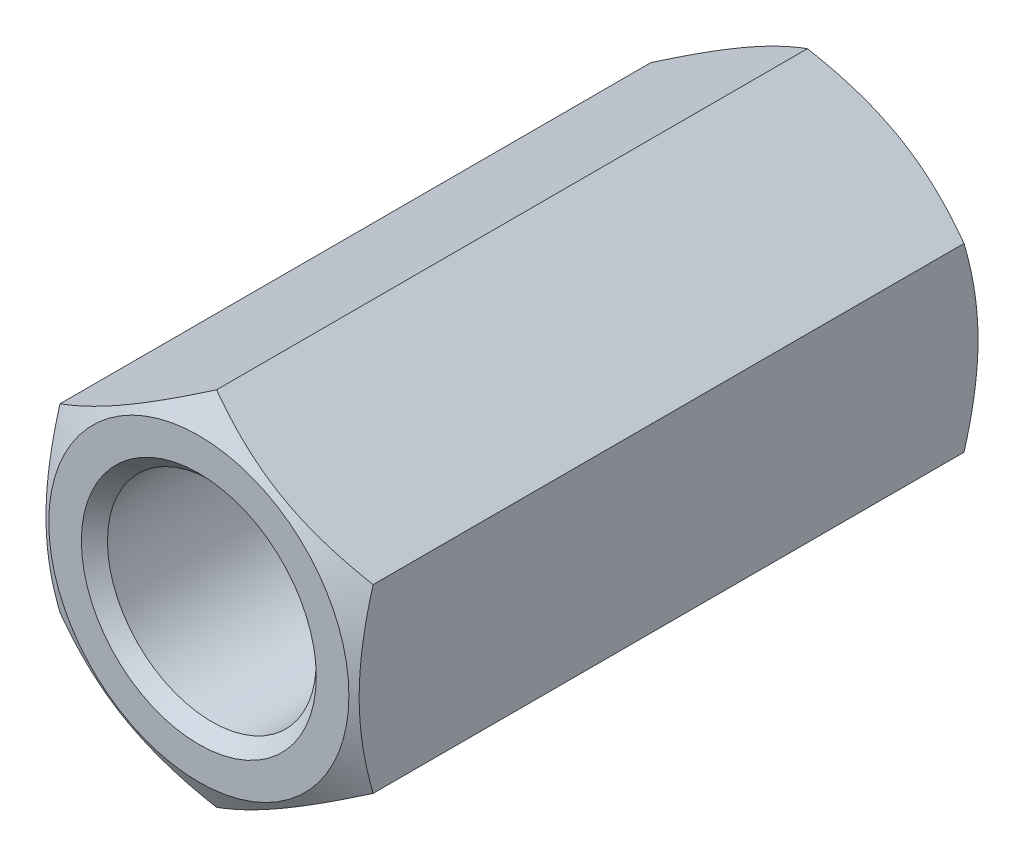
ISO-10303-21;
HEADER;
FILE_DESCRIPTION(('STEP AP214'),'2;1');
FILE_NAME('part.step','',(''),(''),'','','');
FILE_SCHEMA(('AUTOMOTIVE_DESIGN { 1 0 10303 214 1 1 1 1 }'));
ENDSEC;
DATA;
#1=APPLICATION_CONTEXT('core data for automotive mechanical design processes');
#2=APPLICATION_PROTOCOL_DEFINITION('international standard','automotive_design',2000,#1);
#3=PRODUCT_CONTEXT('',#1,'mechanical');
#4=PRODUCT('Part','Part','',(#3));
#5=PRODUCT_RELATED_PRODUCT_CATEGORY('part','',(#4));
#6=PRODUCT_DEFINITION_FORMATION('','',#4);
#7=PRODUCT_DEFINITION_CONTEXT('part definition',#1,'design');
#8=PRODUCT_DEFINITION('design','',#6,#7);
#9=PRODUCT_DEFINITION_SHAPE('','',#8);
#10=(LENGTH_UNIT() NAMED_UNIT(*) SI_UNIT(.MILLI.,.METRE.));
#11=(NAMED_UNIT(*) PLANE_ANGLE_UNIT() SI_UNIT($,.RADIAN.));
#12=(NAMED_UNIT(*) SI_UNIT($,.STERADIAN.) SOLID_ANGLE_UNIT());
#13=UNCERTAINTY_MEASURE_WITH_UNIT(LENGTH_MEASURE(1.E-05),#10,'distance_accuracy_value','');
#14=(GEOMETRIC_REPRESENTATION_CONTEXT(3) GLOBAL_UNCERTAINTY_ASSIGNED_CONTEXT((#13)) GLOBAL_UNIT_ASSIGNED_CONTEXT((#10,
#11,#12)) REPRESENTATION_CONTEXT('',''));
#15=CARTESIAN_POINT('',(0.,0.,0.));
#16=DIRECTION('',(0.,0.,1.));
#17=DIRECTION('',(1.,0.,0.));
#18=AXIS2_PLACEMENT_3D('',#15,#16,#17);
#19=CARTESIAN_POINT('',(-12.,-6.92820323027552,48.));
#20=DIRECTION('',(0.,0.,-1.));
#21=DIRECTION('',(-1.,0.,0.));
#22=AXIS2_PLACEMENT_3D('',#19,#20,#21);
#23=PLANE('',#22);
#24=CARTESIAN_POINT('',(0.,0.,48.));
#25=DIRECTION('',(0.,0.,-1.));
#26=DIRECTION('',(-1.,0.,0.));
#27=AXIS2_PLACEMENT_3D('',#24,#25,#26);
#28=CIRCLE('',#27,9.);
#29=CARTESIAN_POINT('',(-9.,0.,48.));
#30=VERTEX_POINT('',#29);
#31=EDGE_CURVE('E9',#30,#30,#28,.T.);
#32=ORIENTED_EDGE('',*,*,#31,.T.);
#33=EDGE_LOOP('',(#32));
#34=FACE_BOUND('',#33,.T.);
#35=CARTESIAN_POINT('',(0.,0.,48.));
#36=DIRECTION('',(0.,0.,-1.));
#37=DIRECTION('',(-1.,0.,0.));
#38=AXIS2_PLACEMENT_3D('',#35,#36,#37);
#39=CIRCLE('',#38,11.5);
#40=CARTESIAN_POINT('',(-11.5,0.,48.));
#41=VERTEX_POINT('',#40);
#42=EDGE_CURVE('E209',#41,#41,#39,.T.);
#43=ORIENTED_EDGE('',*,*,#42,.F.);
#44=EDGE_LOOP('',(#43));
#45=FACE_BOUND('',#44,.T.);
#46=ADVANCED_FACE('F14',(#34,#45),#23,.F.);
#47=CARTESIAN_POINT('',(-12.,-6.92820323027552,0.));
#48=DIRECTION('',(0.,0.,-1.));
#49=DIRECTION('',(-1.,0.,0.));
#50=AXIS2_PLACEMENT_3D('',#47,#48,#49);
#51=PLANE('',#50);
#52=CARTESIAN_POINT('',(0.,0.,0.));
#53=DIRECTION('',(0.,0.,-1.));
#54=DIRECTION('',(-1.,0.,0.));
#55=AXIS2_PLACEMENT_3D('',#52,#53,#54);
#56=CIRCLE('',#55,9.);
#57=CARTESIAN_POINT('',(-9.,0.,0.));
#58=VERTEX_POINT('',#57);
#59=EDGE_CURVE('E74',#58,#58,#56,.F.);
#60=ORIENTED_EDGE('',*,*,#59,.T.);
#61=EDGE_LOOP('',(#60));
#62=FACE_BOUND('',#61,.T.);
#63=CARTESIAN_POINT('',(0.,0.,0.));
#64=DIRECTION('',(0.,0.,-1.));
#65=DIRECTION('',(-1.,0.,0.));
#66=AXIS2_PLACEMENT_3D('',#63,#64,#65);
#67=CIRCLE('',#66,11.5);
#68=CARTESIAN_POINT('',(-11.5,0.,0.));
#69=VERTEX_POINT('',#68);
#70=EDGE_CURVE('E85',#69,#69,#67,.T.);
#71=ORIENTED_EDGE('',*,*,#70,.T.);
#72=EDGE_LOOP('',(#71));
#73=FACE_BOUND('',#72,.T.);
#74=ADVANCED_FACE('F228',(#62,#73),#51,.T.);
#75=CARTESIAN_POINT('',(0.,-13.856406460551,48.));
#76=DIRECTION('',(-0.5,-0.86602540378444,0.));
#77=DIRECTION('',(0.86602540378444,-0.5,0.));
#78=AXIS2_PLACEMENT_3D('',#75,#76,#77);
#79=PLANE('',#78);
#80=CARTESIAN_POINT('',(0.000199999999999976,-13.8565219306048,1.36053857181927));
#81=CARTESIAN_POINT('',(-0.263585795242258,-13.7042251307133,1.27262476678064));
#82=CARTESIAN_POINT('',(-0.528355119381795,-13.5513604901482,1.18870113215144));
#83=CARTESIAN_POINT('',(-1.06001701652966,-13.244405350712,1.02994135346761));
#84=CARTESIAN_POINT('',(-1.32691025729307,-13.0903144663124,0.955108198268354));
#85=CARTESIAN_POINT('',(-2.131890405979,-12.6255589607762,0.745692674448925));
#86=CARTESIAN_POINT('',(-2.67315507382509,-12.3130596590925,0.626578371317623));
#87=CARTESIAN_POINT('',(-3.48313282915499,-11.8454187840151,0.486906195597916));
#88=CARTESIAN_POINT('',(-3.74942610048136,-11.6916742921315,0.447118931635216));
#89=CARTESIAN_POINT('',(-4.28324559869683,-11.3834734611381,0.380398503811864));
#90=CARTESIAN_POINT('',(-4.55077184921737,-11.2290171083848,0.35346558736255));
#91=CARTESIAN_POINT('',(-5.08627036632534,-10.9198468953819,0.313143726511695));
#92=CARTESIAN_POINT('',(-5.35424172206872,-10.7651335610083,0.299738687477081));
#93=CARTESIAN_POINT('',(-5.89043273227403,-10.4555635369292,0.286758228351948));
#94=CARTESIAN_POINT('',(-6.15865237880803,-10.3007068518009,0.287182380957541));
#95=CARTESIAN_POINT('',(-6.6600893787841,-10.011202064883,0.300895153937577));
#96=CARTESIAN_POINT('',(-6.89334249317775,-9.87653331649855,0.312511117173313));
#97=CARTESIAN_POINT('',(-7.35931224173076,-9.60750555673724,0.345983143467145));
#98=CARTESIAN_POINT('',(-7.59202883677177,-9.47314656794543,0.367839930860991));
#99=CARTESIAN_POINT('',(-8.05679907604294,-9.20481134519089,0.421412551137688));
#100=CARTESIAN_POINT('',(-8.288852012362,-9.07083551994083,0.453136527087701));
#101=CARTESIAN_POINT('',(-8.75186996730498,-8.80351197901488,0.525886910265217));
#102=CARTESIAN_POINT('',(-8.98283491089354,-8.67016430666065,0.566913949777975));
#103=CARTESIAN_POINT('',(-9.68394195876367,-8.26537996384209,0.704986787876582));
#104=CARTESIAN_POINT('',(-10.1520537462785,-7.99511549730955,0.815800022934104));
#105=CARTESIAN_POINT('',(-11.0812971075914,-7.45861659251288,1.06730090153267));
#106=CARTESIAN_POINT('',(-11.5424405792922,-7.19237528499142,1.20792947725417));
#107=CARTESIAN_POINT('',(-12.0002,-6.92808776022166,1.36053857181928));
#108=B_SPLINE_CURVE_WITH_KNOTS('',3,(#80,#81,#82,#83,#84,#85,#86,#87,#88,#89,#90,#91,#92,#93,
#94,#95,#96,#97,#98,#99,#100,#101,#102,#103,#104,#105,#106,#107),.UNSPECIFIED.,.F.,.F.,(4,2,2,2,
2,2,2,2,2,2,2,2,2,4),(0.,0.951004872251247,1.90232158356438,3.80900466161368,4.7389455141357,
5.66890426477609,6.59775529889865,7.5265776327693,8.33514643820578,9.14377244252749,
9.95306755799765,10.7624176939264,12.4167102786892,14.0677556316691),.UNSPECIFIED.);
#109=CARTESIAN_POINT('',(0.,-13.856406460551,1.36047190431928));
#110=VERTEX_POINT('',#109);
#111=CARTESIAN_POINT('',(-12.,-6.92820323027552,1.36047190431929));
#112=VERTEX_POINT('',#111);
#113=EDGE_CURVE('E29',#110,#112,#108,.T.);
#114=ORIENTED_EDGE('',*,*,#113,.F.);
#115=DIRECTION('',(0.,0.,-1.));
#116=VECTOR('',#115,1.);
#117=CARTESIAN_POINT('',(0.,-13.856406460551,48.));
#118=LINE('',#117,#116);
#119=CARTESIAN_POINT('',(0.,-13.856406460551,46.6395280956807));
#120=VERTEX_POINT('',#119);
#121=EDGE_CURVE('E101',#120,#110,#118,.T.);
#122=ORIENTED_EDGE('',*,*,#121,.F.);
#123=CARTESIAN_POINT('',(-12.0002,-6.92808776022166,46.6394614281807));
#124=CARTESIAN_POINT('',(-11.7364142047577,-7.08038456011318,46.7273752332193));
#125=CARTESIAN_POINT('',(-11.4716448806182,-7.2332492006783,46.8112988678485));
#126=CARTESIAN_POINT('',(-10.9399829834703,-7.54020434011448,46.9700586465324));
#127=CARTESIAN_POINT('',(-10.6730897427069,-7.69429522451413,47.0448918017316));
#128=CARTESIAN_POINT('',(-9.86810959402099,-8.15905073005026,47.254307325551));
#129=CARTESIAN_POINT('',(-9.3268449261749,-8.47155003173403,47.3734216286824));
#130=CARTESIAN_POINT('',(-8.516867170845,-8.93919090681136,47.5130938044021));
#131=CARTESIAN_POINT('',(-8.25057389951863,-9.09293539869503,47.5528810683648));
#132=CARTESIAN_POINT('',(-7.71675440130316,-9.4011362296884,47.6196014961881));
#133=CARTESIAN_POINT('',(-7.44922815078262,-9.55559258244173,47.6465344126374));
#134=CARTESIAN_POINT('',(-6.91372963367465,-9.86476279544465,47.6868562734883));
#135=CARTESIAN_POINT('',(-6.64575827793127,-10.0194761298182,47.7002613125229));
#136=CARTESIAN_POINT('',(-6.10956726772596,-10.3290461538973,47.713241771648));
#137=CARTESIAN_POINT('',(-5.84134762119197,-10.4839028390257,47.7128176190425));
#138=CARTESIAN_POINT('',(-5.3399106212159,-10.7734076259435,47.6991048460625));
#139=CARTESIAN_POINT('',(-5.10665750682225,-10.908076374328,47.6874888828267));
#140=CARTESIAN_POINT('',(-4.64068775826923,-11.1771041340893,47.6540168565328));
#141=CARTESIAN_POINT('',(-4.40797116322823,-11.3114631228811,47.632160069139));
#142=CARTESIAN_POINT('',(-3.94320092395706,-11.5797983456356,47.5785874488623));
#143=CARTESIAN_POINT('',(-3.711147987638,-11.7137741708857,47.5468634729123));
#144=CARTESIAN_POINT('',(-3.24813003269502,-11.9810977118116,47.4741130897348));
#145=CARTESIAN_POINT('',(-3.01716508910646,-12.1144453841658,47.433086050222));
#146=CARTESIAN_POINT('',(-2.31605804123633,-12.5192297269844,47.2950132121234));
#147=CARTESIAN_POINT('',(-1.84794625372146,-12.789494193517,47.1841999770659));
#148=CARTESIAN_POINT('',(-0.918702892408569,-13.3259930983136,46.9326990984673));
#149=CARTESIAN_POINT('',(-0.457559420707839,-13.5922344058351,46.7920705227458));
#150=CARTESIAN_POINT('',(0.000199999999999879,-13.8565219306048,46.6394614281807));
#151=B_SPLINE_CURVE_WITH_KNOTS('',3,(#123,#124,#125,#126,#127,#128,#129,#130,#131,#132,#133,
#134,#135,#136,#137,#138,#139,#140,#141,#142,#143,#144,#145,#146,#147,#148,#149,#150),
.UNSPECIFIED.,.F.,.F.,(4,2,2,2,2,2,2,2,2,2,2,2,2,4),(0.,0.951004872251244,1.90232158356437,
3.80900466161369,4.73894551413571,5.6689042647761,6.59775529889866,7.52657763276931,
8.33514643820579,9.14377244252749,9.95306755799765,10.7624176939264,12.4167102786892,
14.0677556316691),.UNSPECIFIED.);
#152=CARTESIAN_POINT('',(-12.,-6.92820323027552,46.6395280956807));
#153=VERTEX_POINT('',#152);
#154=EDGE_CURVE('E92',#153,#120,#151,.T.);
#155=ORIENTED_EDGE('',*,*,#154,.F.);
#156=DIRECTION('',(0.,0.,-1.));
#157=VECTOR('',#156,1.);
#158=CARTESIAN_POINT('',(-12.,-6.92820323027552,48.));
#159=LINE('',#158,#157);
#160=EDGE_CURVE('E88',#153,#112,#159,.T.);
#161=ORIENTED_EDGE('',*,*,#160,.T.);
#162=EDGE_LOOP('',(#114,#122,#155,#161));
#163=FACE_BOUND('',#162,.T.);
#164=ADVANCED_FACE('F124',(#163),#79,.T.);
#165=CARTESIAN_POINT('',(0.,-13.856406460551,48.));
#166=DIRECTION('',(-0.5,0.86602540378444,0.));
#167=DIRECTION('',(-0.86602540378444,-0.5,0.));
#168=AXIS2_PLACEMENT_3D('',#165,#166,#167);
#169=PLANE('',#168);
#170=ORIENTED_EDGE('',*,*,#121,.T.);
#171=CARTESIAN_POINT('',(-0.000200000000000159,-13.8565219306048,1.36053857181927));
#172=CARTESIAN_POINT('',(0.263585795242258,-13.7042251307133,1.27262476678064));
#173=CARTESIAN_POINT('',(0.528355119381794,-13.5513604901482,1.18870113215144));
#174=CARTESIAN_POINT('',(1.06001701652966,-13.244405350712,1.02994135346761));
#175=CARTESIAN_POINT('',(1.32691025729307,-13.0903144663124,0.955108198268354));
#176=CARTESIAN_POINT('',(2.131890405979,-12.6255589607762,0.745692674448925));
#177=CARTESIAN_POINT('',(2.67315507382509,-12.3130596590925,0.626578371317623));
#178=CARTESIAN_POINT('',(3.48313282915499,-11.8454187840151,0.486906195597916));
#179=CARTESIAN_POINT('',(3.74942610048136,-11.6916742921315,0.447118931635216));
#180=CARTESIAN_POINT('',(4.28324559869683,-11.3834734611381,0.380398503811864));
#181=CARTESIAN_POINT('',(4.55077184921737,-11.2290171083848,0.35346558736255));
#182=CARTESIAN_POINT('',(5.08627036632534,-10.9198468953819,0.313143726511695));
#183=CARTESIAN_POINT('',(5.35424172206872,-10.7651335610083,0.29973868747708));
#184=CARTESIAN_POINT('',(5.89043273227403,-10.4555635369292,0.286758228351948));
#185=CARTESIAN_POINT('',(6.15865237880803,-10.3007068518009,0.287182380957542));
#186=CARTESIAN_POINT('',(6.6600893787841,-10.011202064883,0.300895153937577));
#187=CARTESIAN_POINT('',(6.89334249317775,-9.87653331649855,0.312511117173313));
#188=CARTESIAN_POINT('',(7.35931224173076,-9.60750555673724,0.345983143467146));
#189=CARTESIAN_POINT('',(7.59202883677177,-9.47314656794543,0.367839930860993));
#190=CARTESIAN_POINT('',(8.05679907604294,-9.20481134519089,0.421412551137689));
#191=CARTESIAN_POINT('',(8.288852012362,-9.07083551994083,0.453136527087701));
#192=CARTESIAN_POINT('',(8.75186996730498,-8.80351197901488,0.525886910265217));
#193=CARTESIAN_POINT('',(8.98283491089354,-8.67016430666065,0.566913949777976));
#194=CARTESIAN_POINT('',(9.68394195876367,-8.26537996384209,0.704986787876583));
#195=CARTESIAN_POINT('',(10.1520537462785,-7.99511549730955,0.815800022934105));
#196=CARTESIAN_POINT('',(11.0812971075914,-7.45861659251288,1.06730090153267));
#197=CARTESIAN_POINT('',(11.5424405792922,-7.19237528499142,1.20792947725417));
#198=CARTESIAN_POINT('',(12.0002,-6.92808776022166,1.36053857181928));
#199=B_SPLINE_CURVE_WITH_KNOTS('',3,(#171,#172,#173,#174,#175,#176,#177,#178,#179,#180,#181,
#182,#183,#184,#185,#186,#187,#188,#189,#190,#191,#192,#193,#194,#195,#196,#197,#198),
.UNSPECIFIED.,.F.,.F.,(4,2,2,2,2,2,2,2,2,2,2,2,2,4),(0.,0.951004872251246,1.90232158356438,
3.80900466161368,4.7389455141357,5.66890426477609,6.59775529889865,7.5265776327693,
8.33514643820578,9.14377244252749,9.95306755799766,10.7624176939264,12.4167102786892,
14.0677556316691),.UNSPECIFIED.);
#200=CARTESIAN_POINT('',(12.,-6.92820323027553,1.36047190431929));
#201=VERTEX_POINT('',#200);
#202=EDGE_CURVE('E168',#110,#201,#199,.T.);
#203=ORIENTED_EDGE('',*,*,#202,.T.);
#204=DIRECTION('',(0.,0.,-1.));
#205=VECTOR('',#204,1.);
#206=CARTESIAN_POINT('',(12.,-6.92820323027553,48.));
#207=LINE('',#206,#205);
#208=CARTESIAN_POINT('',(12.,-6.92820323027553,46.6395280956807));
#209=VERTEX_POINT('',#208);
#210=EDGE_CURVE('E98',#209,#201,#207,.T.);
#211=ORIENTED_EDGE('',*,*,#210,.F.);
#212=CARTESIAN_POINT('',(12.0002,-6.92808776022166,46.6394614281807));
#213=CARTESIAN_POINT('',(11.7364142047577,-7.08038456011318,46.7273752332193));
#214=CARTESIAN_POINT('',(11.4716448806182,-7.2332492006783,46.8112988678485));
#215=CARTESIAN_POINT('',(10.9399829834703,-7.54020434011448,46.9700586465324));
#216=CARTESIAN_POINT('',(10.6730897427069,-7.69429522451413,47.0448918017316));
#217=CARTESIAN_POINT('',(9.86810959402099,-8.15905073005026,47.254307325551));
#218=CARTESIAN_POINT('',(9.3268449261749,-8.47155003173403,47.3734216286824));
#219=CARTESIAN_POINT('',(8.516867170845,-8.93919090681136,47.5130938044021));
#220=CARTESIAN_POINT('',(8.25057389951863,-9.09293539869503,47.5528810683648));
#221=CARTESIAN_POINT('',(7.71675440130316,-9.4011362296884,47.6196014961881));
#222=CARTESIAN_POINT('',(7.44922815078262,-9.55559258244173,47.6465344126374));
#223=CARTESIAN_POINT('',(6.91372963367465,-9.86476279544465,47.6868562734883));
#224=CARTESIAN_POINT('',(6.64575827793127,-10.0194761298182,47.7002613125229));
#225=CARTESIAN_POINT('',(6.10956726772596,-10.3290461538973,47.713241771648));
#226=CARTESIAN_POINT('',(5.84134762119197,-10.4839028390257,47.7128176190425));
#227=CARTESIAN_POINT('',(5.3399106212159,-10.7734076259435,47.6991048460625));
#228=CARTESIAN_POINT('',(5.10665750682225,-10.908076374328,47.6874888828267));
#229=CARTESIAN_POINT('',(4.64068775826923,-11.1771041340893,47.6540168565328));
#230=CARTESIAN_POINT('',(4.40797116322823,-11.3114631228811,47.632160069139));
#231=CARTESIAN_POINT('',(3.94320092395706,-11.5797983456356,47.5785874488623));
#232=CARTESIAN_POINT('',(3.711147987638,-11.7137741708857,47.5468634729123));
#233=CARTESIAN_POINT('',(3.24813003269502,-11.9810977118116,47.4741130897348));
#234=CARTESIAN_POINT('',(3.01716508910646,-12.1144453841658,47.433086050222));
#235=CARTESIAN_POINT('',(2.31605804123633,-12.5192297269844,47.2950132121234));
#236=CARTESIAN_POINT('',(1.84794625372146,-12.789494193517,47.1841999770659));
#237=CARTESIAN_POINT('',(0.918702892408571,-13.3259930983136,46.9326990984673));
#238=CARTESIAN_POINT('',(0.45755942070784,-13.5922344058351,46.7920705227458));
#239=CARTESIAN_POINT('',(-0.000199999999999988,-13.8565219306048,46.6394614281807));
#240=B_SPLINE_CURVE_WITH_KNOTS('',3,(#212,#213,#214,#215,#216,#217,#218,#219,#220,#221,#222,
#223,#224,#225,#226,#227,#228,#229,#230,#231,#232,#233,#234,#235,#236,#237,#238,#239),
.UNSPECIFIED.,.F.,.F.,(4,2,2,2,2,2,2,2,2,2,2,2,2,4),(0.,0.951004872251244,1.90232158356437,
3.80900466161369,4.73894551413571,5.6689042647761,6.59775529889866,7.52657763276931,
8.33514643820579,9.14377244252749,9.95306755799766,10.7624176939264,12.4167102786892,
14.0677556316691),.UNSPECIFIED.);
#241=EDGE_CURVE('E187',#209,#120,#240,.T.);
#242=ORIENTED_EDGE('',*,*,#241,.T.);
#243=EDGE_LOOP('',(#170,#203,#211,#242));
#244=FACE_BOUND('',#243,.T.);
#245=ADVANCED_FACE('F179',(#244),#169,.F.);
#246=CARTESIAN_POINT('',(12.,-6.92820323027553,48.));
#247=DIRECTION('',(-1.,0.,0.));
#248=DIRECTION('',(0.,-1.,0.));
#249=AXIS2_PLACEMENT_3D('',#246,#247,#248);
#250=PLANE('',#249);
#251=ORIENTED_EDGE('',*,*,#210,.T.);
#252=CARTESIAN_POINT('',(12.,-18.5585732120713,6.12005183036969));
#253=CARTESIAN_POINT('',(12.,-18.2967358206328,5.99310848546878));
#254=CARTESIAN_POINT('',(12.,-18.0345897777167,5.86680207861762));
#255=CARTESIAN_POINT('',(12.,-17.509615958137,5.61560750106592));
#256=CARTESIAN_POINT('',(12.,-17.2467881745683,5.49071934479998));
#257=CARTESIAN_POINT('',(12.,-16.4571148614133,5.11836554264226));
#258=CARTESIAN_POINT('',(12.,-15.9291576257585,4.87324860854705));
#259=CARTESIAN_POINT('',(12.,-14.8667949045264,4.38943935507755));
#260=CARTESIAN_POINT('',(12.,-14.3323699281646,4.15078973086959));
#261=CARTESIAN_POINT('',(12.,-13.259251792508,3.68332207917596));
#262=CARTESIAN_POINT('',(12.,-12.7205588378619,3.45450358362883));
#263=CARTESIAN_POINT('',(12.,-11.6208674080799,3.00223578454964));
#264=CARTESIAN_POINT('',(12.,-11.0597033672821,2.77918694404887));
#265=CARTESIAN_POINT('',(12.,-9.93078708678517,2.35009455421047));
#266=CARTESIAN_POINT('',(12.,-9.36303411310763,2.14405292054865));
#267=CARTESIAN_POINT('',(12.,-8.22113474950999,1.75442460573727));
#268=CARTESIAN_POINT('',(12.,-7.6470041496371,1.57079202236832));
#269=CARTESIAN_POINT('',(12.,-6.49045308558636,1.23189813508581));
#270=CARTESIAN_POINT('',(12.,-5.90803531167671,1.07662784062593));
#271=CARTESIAN_POINT('',(12.,-5.02970127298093,0.871060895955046));
#272=CARTESIAN_POINT('',(12.,-4.7369329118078,0.807230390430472));
#273=CARTESIAN_POINT('',(12.,-4.14940542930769,0.689448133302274));
#274=CARTESIAN_POINT('',(12.,-3.85464634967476,0.635496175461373));
#275=CARTESIAN_POINT('',(12.,-3.26334413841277,0.538426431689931));
#276=CARTESIAN_POINT('',(12.,-2.96680102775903,0.495308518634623));
#277=CARTESIAN_POINT('',(12.,-2.37224958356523,0.420768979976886));
#278=CARTESIAN_POINT('',(12.,-2.07424130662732,0.389346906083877));
#279=CARTESIAN_POINT('',(12.,-1.48104452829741,0.339214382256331));
#280=CARTESIAN_POINT('',(12.,-1.185869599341,0.320344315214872));
#281=CARTESIAN_POINT('',(12.,-0.594987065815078,0.29510020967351));
#282=CARTESIAN_POINT('',(12.,-0.299279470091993,0.288725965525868));
#283=CARTESIAN_POINT('',(12.,0.292141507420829,0.288624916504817));
#284=CARTESIAN_POINT('',(12.,0.58785488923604,0.294898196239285));
#285=CARTESIAN_POINT('',(12.,1.17875565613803,0.31994010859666));
#286=CARTESIAN_POINT('',(12.,1.47394301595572,0.338709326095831));
#287=CARTESIAN_POINT('',(12.,2.18492560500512,0.39856954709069));
#288=CARTESIAN_POINT('',(12.,2.60022317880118,0.445675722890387));
#289=CARTESIAN_POINT('',(12.,3.42770467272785,0.562044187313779));
#290=CARTESIAN_POINT('',(12.,3.83988815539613,0.631309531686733));
#291=CARTESIAN_POINT('',(12.,4.66075898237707,0.789532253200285));
#292=CARTESIAN_POINT('',(12.,5.0694433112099,0.878505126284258));
#293=CARTESIAN_POINT('',(12.,5.88269706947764,1.07343097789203));
#294=CARTESIAN_POINT('',(12.,6.28726656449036,1.17938368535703));
#295=CARTESIAN_POINT('',(12.,7.10117496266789,1.40819498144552));
#296=CARTESIAN_POINT('',(12.,7.51042314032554,1.53137406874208));
#297=CARTESIAN_POINT('',(12.,8.3248872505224,1.79034336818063));
#298=CARTESIAN_POINT('',(12.,8.73010315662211,1.92613366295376));
#299=CARTESIAN_POINT('',(12.,9.53670521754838,2.20817941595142));
#300=CARTESIAN_POINT('',(12.,9.93809262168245,2.35443131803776));
#301=CARTESIAN_POINT('',(12.,10.7375489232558,2.65569101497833));
#302=CARTESIAN_POINT('',(12.,11.1356178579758,2.81069871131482));
#303=CARTESIAN_POINT('',(12.,12.0686654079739,3.18396199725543));
#304=CARTESIAN_POINT('',(12.,12.6024298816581,3.405247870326));
#305=CARTESIAN_POINT('',(12.,13.6654795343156,3.85835939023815));
#306=CARTESIAN_POINT('',(12.,14.1947644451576,4.09018566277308));
#307=CARTESIAN_POINT('',(12.,15.2496817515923,4.56228349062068));
#308=CARTESIAN_POINT('',(12.,15.7753133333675,4.80255685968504));
#309=CARTESIAN_POINT('',(12.,16.8234149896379,5.28985879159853));
#310=CARTESIAN_POINT('',(12.,17.3458851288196,5.53688721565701));
#311=CARTESIAN_POINT('',(12.,18.3887401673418,6.03671201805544));
#312=CARTESIAN_POINT('',(12.,18.9091222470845,6.28951426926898));
#313=CARTESIAN_POINT('',(12.,19.9476592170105,6.79965199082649));
#314=CARTESIAN_POINT('',(12.,20.4658140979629,7.05698747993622));
#315=CARTESIAN_POINT('',(12.,21.5001721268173,7.57538767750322));
#316=CARTESIAN_POINT('',(12.,22.0163755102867,7.83645191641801));
#317=CARTESIAN_POINT('',(12.,23.0471754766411,8.36173524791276));
#318=CARTESIAN_POINT('',(12.,23.5617720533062,8.625954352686));
#319=CARTESIAN_POINT('',(12.,25.0183427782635,9.37858705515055));
#320=CARTESIAN_POINT('',(12.,25.9586959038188,9.87013778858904));
#321=CARTESIAN_POINT('',(12.,27.8359115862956,10.8599214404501));
#322=CARTESIAN_POINT('',(12.,28.7727740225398,11.3581545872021));
#323=CARTESIAN_POINT('',(12.,30.6414809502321,12.3585263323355));
#324=CARTESIAN_POINT('',(12.,31.5733321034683,12.8606524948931));
#325=CARTESIAN_POINT('',(12.,32.9694593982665,13.6168240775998));
#326=CARTESIAN_POINT('',(12.,33.4345480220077,13.8693716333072));
#327=CARTESIAN_POINT('',(12.,34.3642372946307,14.375361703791));
#328=CARTESIAN_POINT('',(12.,34.8288379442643,14.6288042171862));
#329=CARTESIAN_POINT('',(12.,35.2932221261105,14.8826428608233));
#330=B_SPLINE_CURVE_WITH_KNOTS('',3,(#252,#253,#254,#255,#256,#257,#258,#259,#260,#261,#262,
#263,#264,#265,#266,#267,#268,#269,#270,#271,#272,#273,#274,#275,#276,#277,#278,#279,#280,#281,
#282,#283,#284,#285,#286,#287,#288,#289,#290,#291,#292,#293,#294,#295,#296,#297,#298,#299,#300,
#301,#302,#303,#304,#305,#306,#307,#308,#309,#310,#311,#312,#313,#314,#315,#316,#317,#318,#319,
#320,#321,#322,#323,#324,#325,#326,#327,#328,#329),.UNSPECIFIED.,.F.,.F.,(4,2,2,2,2,2,2,2,2,2,2,
2,2,2,2,2,2,2,2,2,2,2,2,2,2,2,2,2,2,2,2,2,2,2,2,2,2,2,4),(0.,0.87295939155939,1.74592765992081,
3.49212522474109,5.24791634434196,7.00362377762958,8.81501559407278,10.6266111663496,
12.4344312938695,14.2416773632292,15.1404752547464,16.0392543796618,16.9380229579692,
17.8367570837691,18.7238321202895,19.6108925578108,20.4979589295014,21.3850668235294,
22.6382540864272,23.8916142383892,25.1459634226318,26.400292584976,27.6822016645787,
28.9641191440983,30.2456029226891,31.5270722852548,33.2603688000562,34.9937683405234,
36.7275423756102,38.4612808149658,40.1968690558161,41.932464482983,43.6678432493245,
45.4032287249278,48.586421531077,51.7697233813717,54.9452880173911,56.5329866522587,
58.1206828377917),.UNSPECIFIED.);
#331=CARTESIAN_POINT('',(12.,6.92820323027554,1.3604719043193));
#332=VERTEX_POINT('',#331);
#333=EDGE_CURVE('E162',#201,#332,#330,.T.);
#334=ORIENTED_EDGE('',*,*,#333,.T.);
#335=DIRECTION('',(0.,0.,-1.));
#336=VECTOR('',#335,1.);
#337=CARTESIAN_POINT('',(12.,6.92820323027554,48.));
#338=LINE('',#337,#336);
#339=CARTESIAN_POINT('',(12.,6.92820323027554,46.6395280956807));
#340=VERTEX_POINT('',#339);
#341=EDGE_CURVE('E90',#340,#332,#338,.T.);
#342=ORIENTED_EDGE('',*,*,#341,.F.);
#343=CARTESIAN_POINT('',(12.,-18.5585732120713,41.8799481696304));
#344=CARTESIAN_POINT('',(12.,-18.2967358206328,42.0068915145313));
#345=CARTESIAN_POINT('',(12.,-18.0345897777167,42.1331979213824));
#346=CARTESIAN_POINT('',(12.,-17.509615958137,42.3843924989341));
#347=CARTESIAN_POINT('',(12.,-17.2467881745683,42.5092806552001));
#348=CARTESIAN_POINT('',(12.,-16.4571148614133,42.8816344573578));
#349=CARTESIAN_POINT('',(12.,-15.9291576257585,43.126751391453));
#350=CARTESIAN_POINT('',(12.,-14.8667949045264,43.6105606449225));
#351=CARTESIAN_POINT('',(12.,-14.3323699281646,43.8492102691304));
#352=CARTESIAN_POINT('',(12.,-13.259251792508,44.3166779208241));
#353=CARTESIAN_POINT('',(12.,-12.7205588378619,44.5454964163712));
#354=CARTESIAN_POINT('',(12.,-11.6208674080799,44.9977642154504));
#355=CARTESIAN_POINT('',(12.,-11.0597033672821,45.2208130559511));
#356=CARTESIAN_POINT('',(12.,-9.93078708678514,45.6499054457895));
#357=CARTESIAN_POINT('',(12.,-9.36303411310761,45.8559470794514));
#358=CARTESIAN_POINT('',(12.,-8.22113474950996,46.2455753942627));
#359=CARTESIAN_POINT('',(12.,-7.64700414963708,46.4292079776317));
#360=CARTESIAN_POINT('',(12.,-6.49045308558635,46.7681018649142));
#361=CARTESIAN_POINT('',(12.,-5.90803531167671,46.9233721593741));
#362=CARTESIAN_POINT('',(12.,-5.02970127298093,47.128939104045));
#363=CARTESIAN_POINT('',(12.,-4.73693291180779,47.1927696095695));
#364=CARTESIAN_POINT('',(12.,-4.14940542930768,47.3105518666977));
#365=CARTESIAN_POINT('',(12.,-3.85464634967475,47.3645038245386));
#366=CARTESIAN_POINT('',(12.,-3.26334413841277,47.4615735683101));
#367=CARTESIAN_POINT('',(12.,-2.96680102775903,47.5046914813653));
#368=CARTESIAN_POINT('',(12.,-2.37224958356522,47.5792310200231));
#369=CARTESIAN_POINT('',(12.,-2.07424130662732,47.6106530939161));
#370=CARTESIAN_POINT('',(12.,-1.48104452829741,47.6607856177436));
#371=CARTESIAN_POINT('',(12.,-1.185869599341,47.6796556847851));
#372=CARTESIAN_POINT('',(12.,-0.594987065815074,47.7048997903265));
#373=CARTESIAN_POINT('',(12.,-0.299279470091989,47.7112740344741));
#374=CARTESIAN_POINT('',(12.,0.292141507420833,47.7113750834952));
#375=CARTESIAN_POINT('',(12.,0.587854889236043,47.7051018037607));
#376=CARTESIAN_POINT('',(12.,1.17875565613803,47.6800598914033));
#377=CARTESIAN_POINT('',(12.,1.47394301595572,47.6612906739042));
#378=CARTESIAN_POINT('',(12.,2.18492560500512,47.6014304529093));
#379=CARTESIAN_POINT('',(12.,2.60022317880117,47.5543242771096));
#380=CARTESIAN_POINT('',(12.,3.42770467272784,47.4379558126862));
#381=CARTESIAN_POINT('',(12.,3.83988815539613,47.3686904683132));
#382=CARTESIAN_POINT('',(12.,4.66075898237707,47.2104677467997));
#383=CARTESIAN_POINT('',(12.,5.0694433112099,47.1214948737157));
#384=CARTESIAN_POINT('',(12.,5.88269706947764,46.9265690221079));
#385=CARTESIAN_POINT('',(12.,6.28726656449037,46.820616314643));
#386=CARTESIAN_POINT('',(12.,7.1011749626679,46.5918050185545));
#387=CARTESIAN_POINT('',(12.,7.51042314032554,46.4686259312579));
#388=CARTESIAN_POINT('',(12.,8.32488725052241,46.2096566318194));
#389=CARTESIAN_POINT('',(12.,8.73010315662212,46.0738663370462));
#390=CARTESIAN_POINT('',(12.,9.5367052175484,45.7918205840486));
#391=CARTESIAN_POINT('',(12.,9.93809262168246,45.6455686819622));
#392=CARTESIAN_POINT('',(12.,10.7375489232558,45.3443089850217));
#393=CARTESIAN_POINT('',(12.,11.1356178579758,45.1893012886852));
#394=CARTESIAN_POINT('',(12.,12.0686654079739,44.8160380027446));
#395=CARTESIAN_POINT('',(12.,12.6024298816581,44.594752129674));
#396=CARTESIAN_POINT('',(12.,13.6654795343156,44.1416406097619));
#397=CARTESIAN_POINT('',(12.,14.1947644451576,43.9098143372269));
#398=CARTESIAN_POINT('',(12.,15.2496817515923,43.4377165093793));
#399=CARTESIAN_POINT('',(12.,15.7753133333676,43.197443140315));
#400=CARTESIAN_POINT('',(12.,16.8234149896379,42.7101412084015));
#401=CARTESIAN_POINT('',(12.,17.3458851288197,42.463112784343));
#402=CARTESIAN_POINT('',(12.,18.3887401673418,41.9632879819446));
#403=CARTESIAN_POINT('',(12.,18.9091222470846,41.7104857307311));
#404=CARTESIAN_POINT('',(12.,19.9476592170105,41.2003480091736));
#405=CARTESIAN_POINT('',(12.,20.4658140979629,40.9430125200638));
#406=CARTESIAN_POINT('',(12.,21.5001721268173,40.4246123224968));
#407=CARTESIAN_POINT('',(12.,22.0163755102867,40.163548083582));
#408=CARTESIAN_POINT('',(12.,23.0471754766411,39.6382647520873));
#409=CARTESIAN_POINT('',(12.,23.5617720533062,39.3740456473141));
#410=CARTESIAN_POINT('',(12.,25.0183427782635,38.6214129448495));
#411=CARTESIAN_POINT('',(12.,25.9586959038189,38.129862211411));
#412=CARTESIAN_POINT('',(12.,27.8359115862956,37.14007855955));
#413=CARTESIAN_POINT('',(12.,28.7727740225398,36.641845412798));
#414=CARTESIAN_POINT('',(12.,30.6414809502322,35.6414736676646));
#415=CARTESIAN_POINT('',(12.,31.5733321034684,35.139347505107));
#416=CARTESIAN_POINT('',(12.,32.9694593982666,34.3831759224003));
#417=CARTESIAN_POINT('',(12.,33.4345480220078,34.130628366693));
#418=CARTESIAN_POINT('',(12.,34.3642372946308,33.6246382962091));
#419=CARTESIAN_POINT('',(12.,34.8288379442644,33.3711957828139));
#420=CARTESIAN_POINT('',(12.,35.2932221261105,33.1173571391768));
#421=B_SPLINE_CURVE_WITH_KNOTS('',3,(#343,#344,#345,#346,#347,#348,#349,#350,#351,#352,#353,
#354,#355,#356,#357,#358,#359,#360,#361,#362,#363,#364,#365,#366,#367,#368,#369,#370,#371,#372,
#373,#374,#375,#376,#377,#378,#379,#380,#381,#382,#383,#384,#385,#386,#387,#388,#389,#390,#391,
#392,#393,#394,#395,#396,#397,#398,#399,#400,#401,#402,#403,#404,#405,#406,#407,#408,#409,#410,
#411,#412,#413,#414,#415,#416,#417,#418,#419,#420),.UNSPECIFIED.,.F.,.F.,(4,2,2,2,2,2,2,2,2,2,2,
2,2,2,2,2,2,2,2,2,2,2,2,2,2,2,2,2,2,2,2,2,2,2,2,2,2,2,4),(0.,0.872959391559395,1.74592765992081,
3.4921252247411,5.24791634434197,7.00362377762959,8.81501559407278,10.6266111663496,
12.4344312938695,14.2416773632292,15.1404752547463,16.0392543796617,16.9380229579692,
17.8367570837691,18.7238321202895,19.6108925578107,20.4979589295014,21.3850668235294,
22.6382540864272,23.8916142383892,25.1459634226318,26.400292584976,27.6822016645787,
28.9641191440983,30.2456029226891,31.5270722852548,33.2603688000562,34.9937683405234,
36.7275423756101,38.4612808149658,40.1968690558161,41.932464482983,43.6678432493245,
45.4032287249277,48.586421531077,51.7697233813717,54.9452880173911,56.5329866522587,
58.1206828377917),.UNSPECIFIED.);
#422=EDGE_CURVE('E194',#340,#209,#421,.F.);
#423=ORIENTED_EDGE('',*,*,#422,.T.);
#424=EDGE_LOOP('',(#251,#334,#342,#423));
#425=FACE_BOUND('',#424,.T.);
#426=ADVANCED_FACE('F182',(#425),#250,.F.);
#427=CARTESIAN_POINT('',(12.,6.92820323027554,48.));
#428=DIRECTION('',(-0.5,-0.86602540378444,0.));
#429=DIRECTION('',(0.86602540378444,-0.5,0.));
#430=AXIS2_PLACEMENT_3D('',#427,#428,#429);
#431=PLANE('',#430);
#432=ORIENTED_EDGE('',*,*,#341,.T.);
#433=CARTESIAN_POINT('',(12.0002,6.9280877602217,1.36053857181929));
#434=CARTESIAN_POINT('',(11.7364142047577,7.08038456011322,1.27262476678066));
#435=CARTESIAN_POINT('',(11.4716448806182,7.23324920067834,1.18870113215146));
#436=CARTESIAN_POINT('',(10.9399829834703,7.54020434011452,1.02994135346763));
#437=CARTESIAN_POINT('',(10.6730897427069,7.69429522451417,0.955108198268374));
#438=CARTESIAN_POINT('',(9.86810959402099,8.1590507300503,0.745692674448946));
#439=CARTESIAN_POINT('',(9.3268449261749,8.47155003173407,0.626578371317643));
#440=CARTESIAN_POINT('',(8.51686717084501,8.93919090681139,0.486906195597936));
#441=CARTESIAN_POINT('',(8.25057389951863,9.09293539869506,0.447118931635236));
#442=CARTESIAN_POINT('',(7.71675440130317,9.40113622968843,0.380398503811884));
#443=CARTESIAN_POINT('',(7.44922815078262,9.55559258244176,0.35346558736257));
#444=CARTESIAN_POINT('',(6.91372963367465,9.86476279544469,0.313143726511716));
#445=CARTESIAN_POINT('',(6.64575827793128,10.0194761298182,0.299738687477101));
#446=CARTESIAN_POINT('',(6.10956726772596,10.3290461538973,0.286758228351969));
#447=CARTESIAN_POINT('',(5.84134762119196,10.4839028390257,0.287182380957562));
#448=CARTESIAN_POINT('',(5.33991062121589,10.7734076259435,0.300895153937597));
#449=CARTESIAN_POINT('',(5.10665750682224,10.908076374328,0.312511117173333));
#450=CARTESIAN_POINT('',(4.64068775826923,11.1771041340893,0.345983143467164));
#451=CARTESIAN_POINT('',(4.40797116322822,11.3114631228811,0.367839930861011));
#452=CARTESIAN_POINT('',(3.94320092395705,11.5797983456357,0.421412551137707));
#453=CARTESIAN_POINT('',(3.71114798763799,11.7137741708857,0.453136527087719));
#454=CARTESIAN_POINT('',(3.24813003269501,11.9810977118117,0.525886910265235));
#455=CARTESIAN_POINT('',(3.01716508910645,12.1144453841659,0.566913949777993));
#456=CARTESIAN_POINT('',(2.31605804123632,12.5192297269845,0.7049867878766));
#457=CARTESIAN_POINT('',(1.84794625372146,12.789494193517,0.815800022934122));
#458=CARTESIAN_POINT('',(0.918702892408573,13.3259930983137,1.06730090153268));
#459=CARTESIAN_POINT('',(0.457559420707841,13.5922344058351,1.20792947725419));
#460=CARTESIAN_POINT('',(-0.000200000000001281,13.8565219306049,1.36053857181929));
#461=B_SPLINE_CURVE_WITH_KNOTS('',3,(#433,#434,#435,#436,#437,#438,#439,#440,#441,#442,#443,
#444,#445,#446,#447,#448,#449,#450,#451,#452,#453,#454,#455,#456,#457,#458,#459,#460),
.UNSPECIFIED.,.F.,.F.,(4,2,2,2,2,2,2,2,2,2,2,2,2,4),(0.,0.951004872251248,1.90232158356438,
3.80900466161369,4.7389455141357,5.66890426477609,6.59775529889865,7.52657763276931,
8.33514643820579,9.1437724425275,9.95306755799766,10.7624176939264,12.4167102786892,
14.0677556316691),.UNSPECIFIED.);
#462=CARTESIAN_POINT('',(0.,13.856406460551,1.36047190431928));
#463=VERTEX_POINT('',#462);
#464=EDGE_CURVE('E84',#332,#463,#461,.T.);
#465=ORIENTED_EDGE('',*,*,#464,.T.);
#466=DIRECTION('',(0.,0.,-1.));
#467=VECTOR('',#466,1.);
#468=CARTESIAN_POINT('',(0.,13.856406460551,48.));
#469=LINE('',#468,#467);
#470=CARTESIAN_POINT('',(0.,13.856406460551,46.6395280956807));
#471=VERTEX_POINT('',#470);
#472=EDGE_CURVE('E83',#471,#463,#469,.T.);
#473=ORIENTED_EDGE('',*,*,#472,.F.);
#474=CARTESIAN_POINT('',(-0.000200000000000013,13.8565219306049,46.6394614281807));
#475=CARTESIAN_POINT('',(0.26358579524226,13.7042251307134,46.7273752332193));
#476=CARTESIAN_POINT('',(0.528355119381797,13.5513604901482,46.8112988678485));
#477=CARTESIAN_POINT('',(1.06001701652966,13.2444053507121,46.9700586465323));
#478=CARTESIAN_POINT('',(1.32691025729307,13.0903144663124,47.0448918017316));
#479=CARTESIAN_POINT('',(2.13189040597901,12.6255589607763,47.254307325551));
#480=CARTESIAN_POINT('',(2.67315507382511,12.3130596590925,47.3734216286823));
#481=CARTESIAN_POINT('',(3.48313282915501,11.8454187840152,47.513093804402));
#482=CARTESIAN_POINT('',(3.74942610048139,11.6916742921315,47.5528810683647));
#483=CARTESIAN_POINT('',(4.28324559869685,11.3834734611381,47.6196014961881));
#484=CARTESIAN_POINT('',(4.5507718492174,11.2290171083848,47.6465344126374));
#485=CARTESIAN_POINT('',(5.08627036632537,10.9198468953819,47.6868562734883));
#486=CARTESIAN_POINT('',(5.35424172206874,10.7651335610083,47.7002613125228));
#487=CARTESIAN_POINT('',(5.89043273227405,10.4555635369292,47.713241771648));
#488=CARTESIAN_POINT('',(6.15865237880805,10.3007068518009,47.7128176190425));
#489=CARTESIAN_POINT('',(6.66008937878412,10.0112020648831,47.6991048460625));
#490=CARTESIAN_POINT('',(6.89334249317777,9.87653331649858,47.6874888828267));
#491=CARTESIAN_POINT('',(7.35931224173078,9.60750555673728,47.6540168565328));
#492=CARTESIAN_POINT('',(7.59202883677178,9.47314656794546,47.632160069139));
#493=CARTESIAN_POINT('',(8.05679907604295,9.20481134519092,47.5785874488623));
#494=CARTESIAN_POINT('',(8.28885201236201,9.07083551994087,47.5468634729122));
#495=CARTESIAN_POINT('',(8.75186996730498,8.80351197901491,47.4741130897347));
#496=CARTESIAN_POINT('',(8.98283491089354,8.67016430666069,47.433086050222));
#497=CARTESIAN_POINT('',(9.68394195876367,8.26537996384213,47.2950132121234));
#498=CARTESIAN_POINT('',(10.1520537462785,7.99511549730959,47.1841999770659));
#499=CARTESIAN_POINT('',(11.0812971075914,7.45861659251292,46.9326990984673));
#500=CARTESIAN_POINT('',(11.5424405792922,7.19237528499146,46.7920705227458));
#501=CARTESIAN_POINT('',(12.0002,6.9280877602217,46.6394614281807));
#502=B_SPLINE_CURVE_WITH_KNOTS('',3,(#474,#475,#476,#477,#478,#479,#480,#481,#482,#483,#484,
#485,#486,#487,#488,#489,#490,#491,#492,#493,#494,#495,#496,#497,#498,#499,#500,#501),
.UNSPECIFIED.,.F.,.F.,(4,2,2,2,2,2,2,2,2,2,2,2,2,4),(0.,0.951004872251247,1.90232158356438,
3.8090046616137,4.73894551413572,5.66890426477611,6.59775529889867,7.52657763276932,
8.3351464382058,9.1437724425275,9.95306755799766,10.7624176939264,12.4167102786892,
14.0677556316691),.UNSPECIFIED.);
#503=EDGE_CURVE('E212',#471,#340,#502,.T.);
#504=ORIENTED_EDGE('',*,*,#503,.T.);
#505=EDGE_LOOP('',(#432,#465,#473,#504));
#506=FACE_BOUND('',#505,.T.);
#507=ADVANCED_FACE('F131',(#506),#431,.F.);
#508=CARTESIAN_POINT('',(0.,13.856406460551,48.));
#509=DIRECTION('',(0.5,-0.86602540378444,0.));
#510=DIRECTION('',(0.86602540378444,0.5,0.));
#511=AXIS2_PLACEMENT_3D('',#508,#509,#510);
#512=PLANE('',#511);
#513=ORIENTED_EDGE('',*,*,#472,.T.);
#514=CARTESIAN_POINT('',(0.000200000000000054,13.8565219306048,1.36053857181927));
#515=CARTESIAN_POINT('',(-0.263585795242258,13.7042251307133,1.27262476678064));
#516=CARTESIAN_POINT('',(-0.528355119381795,13.5513604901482,1.18870113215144));
#517=CARTESIAN_POINT('',(-1.06001701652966,13.244405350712,1.02994135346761));
#518=CARTESIAN_POINT('',(-1.32691025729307,13.0903144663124,0.955108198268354));
#519=CARTESIAN_POINT('',(-2.131890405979,12.6255589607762,0.745692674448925));
#520=CARTESIAN_POINT('',(-2.67315507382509,12.3130596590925,0.626578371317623));
#521=CARTESIAN_POINT('',(-3.48313282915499,11.8454187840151,0.486906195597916));
#522=CARTESIAN_POINT('',(-3.74942610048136,11.6916742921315,0.447118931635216));
#523=CARTESIAN_POINT('',(-4.28324559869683,11.3834734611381,0.380398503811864));
#524=CARTESIAN_POINT('',(-4.55077184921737,11.2290171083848,0.35346558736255));
#525=CARTESIAN_POINT('',(-5.08627036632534,10.9198468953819,0.313143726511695));
#526=CARTESIAN_POINT('',(-5.35424172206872,10.7651335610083,0.299738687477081));
#527=CARTESIAN_POINT('',(-5.89043273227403,10.4555635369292,0.286758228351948));
#528=CARTESIAN_POINT('',(-6.15865237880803,10.3007068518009,0.287182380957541));
#529=CARTESIAN_POINT('',(-6.6600893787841,10.011202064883,0.300895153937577));
#530=CARTESIAN_POINT('',(-6.89334249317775,9.87653331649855,0.312511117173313));
#531=CARTESIAN_POINT('',(-7.35931224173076,9.60750555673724,0.345983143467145));
#532=CARTESIAN_POINT('',(-7.59202883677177,9.47314656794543,0.367839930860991));
#533=CARTESIAN_POINT('',(-8.05679907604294,9.20481134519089,0.421412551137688));
#534=CARTESIAN_POINT('',(-8.288852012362,9.07083551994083,0.453136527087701));
#535=CARTESIAN_POINT('',(-8.75186996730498,8.80351197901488,0.525886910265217));
#536=CARTESIAN_POINT('',(-8.98283491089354,8.67016430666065,0.566913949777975));
#537=CARTESIAN_POINT('',(-9.68394195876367,8.26537996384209,0.704986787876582));
#538=CARTESIAN_POINT('',(-10.1520537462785,7.99511549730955,0.815800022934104));
#539=CARTESIAN_POINT('',(-11.0812971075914,7.45861659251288,1.06730090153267));
#540=CARTESIAN_POINT('',(-11.5424405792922,7.19237528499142,1.20792947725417));
#541=CARTESIAN_POINT('',(-12.0002,6.92808776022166,1.36053857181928));
#542=B_SPLINE_CURVE_WITH_KNOTS('',3,(#514,#515,#516,#517,#518,#519,#520,#521,#522,#523,#524,
#525,#526,#527,#528,#529,#530,#531,#532,#533,#534,#535,#536,#537,#538,#539,#540,#541),
.UNSPECIFIED.,.F.,.F.,(4,2,2,2,2,2,2,2,2,2,2,2,2,4),(0.,0.951004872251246,1.90232158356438,
3.80900466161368,4.7389455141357,5.66890426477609,6.59775529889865,7.5265776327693,
8.33514643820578,9.14377244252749,9.95306755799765,10.7624176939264,12.4167102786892,
14.0677556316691),.UNSPECIFIED.);
#543=CARTESIAN_POINT('',(-12.,6.92820323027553,1.36047190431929));
#544=VERTEX_POINT('',#543);
#545=EDGE_CURVE('E68',#463,#544,#542,.T.);
#546=ORIENTED_EDGE('',*,*,#545,.T.);
#547=DIRECTION('',(0.,0.,-1.));
#548=VECTOR('',#547,1.);
#549=CARTESIAN_POINT('',(-12.,6.92820323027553,48.));
#550=LINE('',#549,#548);
#551=CARTESIAN_POINT('',(-12.,6.92820323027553,46.6395280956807));
#552=VERTEX_POINT('',#551);
#553=EDGE_CURVE('E81',#552,#544,#550,.T.);
#554=ORIENTED_EDGE('',*,*,#553,.F.);
#555=CARTESIAN_POINT('',(-12.0002,6.92808776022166,46.6394614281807));
#556=CARTESIAN_POINT('',(-11.7364142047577,7.08038456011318,46.7273752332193));
#557=CARTESIAN_POINT('',(-11.4716448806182,7.2332492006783,46.8112988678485));
#558=CARTESIAN_POINT('',(-10.9399829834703,7.54020434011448,46.9700586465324));
#559=CARTESIAN_POINT('',(-10.6730897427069,7.69429522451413,47.0448918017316));
#560=CARTESIAN_POINT('',(-9.86810959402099,8.15905073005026,47.254307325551));
#561=CARTESIAN_POINT('',(-9.3268449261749,8.47155003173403,47.3734216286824));
#562=CARTESIAN_POINT('',(-8.516867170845,8.93919090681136,47.5130938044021));
#563=CARTESIAN_POINT('',(-8.25057389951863,9.09293539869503,47.5528810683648));
#564=CARTESIAN_POINT('',(-7.71675440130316,9.4011362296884,47.6196014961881));
#565=CARTESIAN_POINT('',(-7.44922815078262,9.55559258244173,47.6465344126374));
#566=CARTESIAN_POINT('',(-6.91372963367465,9.86476279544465,47.6868562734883));
#567=CARTESIAN_POINT('',(-6.64575827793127,10.0194761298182,47.7002613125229));
#568=CARTESIAN_POINT('',(-6.10956726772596,10.3290461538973,47.713241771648));
#569=CARTESIAN_POINT('',(-5.84134762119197,10.4839028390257,47.7128176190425));
#570=CARTESIAN_POINT('',(-5.3399106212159,10.7734076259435,47.6991048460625));
#571=CARTESIAN_POINT('',(-5.10665750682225,10.908076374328,47.6874888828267));
#572=CARTESIAN_POINT('',(-4.64068775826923,11.1771041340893,47.6540168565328));
#573=CARTESIAN_POINT('',(-4.40797116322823,11.3114631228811,47.632160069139));
#574=CARTESIAN_POINT('',(-3.94320092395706,11.5797983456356,47.5785874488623));
#575=CARTESIAN_POINT('',(-3.711147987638,11.7137741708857,47.5468634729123));
#576=CARTESIAN_POINT('',(-3.24813003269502,11.9810977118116,47.4741130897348));
#577=CARTESIAN_POINT('',(-3.01716508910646,12.1144453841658,47.433086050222));
#578=CARTESIAN_POINT('',(-2.31605804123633,12.5192297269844,47.2950132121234));
#579=CARTESIAN_POINT('',(-1.84794625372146,12.789494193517,47.1841999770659));
#580=CARTESIAN_POINT('',(-0.918702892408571,13.3259930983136,46.9326990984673));
#581=CARTESIAN_POINT('',(-0.45755942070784,13.5922344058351,46.7920705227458));
#582=CARTESIAN_POINT('',(0.000199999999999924,13.8565219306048,46.6394614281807));
#583=B_SPLINE_CURVE_WITH_KNOTS('',3,(#555,#556,#557,#558,#559,#560,#561,#562,#563,#564,#565,
#566,#567,#568,#569,#570,#571,#572,#573,#574,#575,#576,#577,#578,#579,#580,#581,#582),
.UNSPECIFIED.,.F.,.F.,(4,2,2,2,2,2,2,2,2,2,2,2,2,4),(0.,0.951004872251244,1.90232158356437,
3.80900466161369,4.73894551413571,5.6689042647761,6.59775529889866,7.52657763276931,
8.33514643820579,9.14377244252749,9.95306755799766,10.7624176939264,12.4167102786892,
14.0677556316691),.UNSPECIFIED.);
#584=EDGE_CURVE('E37',#552,#471,#583,.T.);
#585=ORIENTED_EDGE('',*,*,#584,.T.);
#586=EDGE_LOOP('',(#513,#546,#554,#585));
#587=FACE_BOUND('',#586,.T.);
#588=ADVANCED_FACE('F80',(#587),#512,.F.);
#589=CARTESIAN_POINT('',(-12.,-6.92820323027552,48.));
#590=DIRECTION('',(-1.,0.,0.));
#591=DIRECTION('',(0.,-1.,0.));
#592=AXIS2_PLACEMENT_3D('',#589,#590,#591);
#593=PLANE('',#592);
#594=CARTESIAN_POINT('',(-12.,-18.5585732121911,6.12005183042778));
#595=CARTESIAN_POINT('',(-12.,-18.2967358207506,5.99310848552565));
#596=CARTESIAN_POINT('',(-12.,-18.0345897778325,5.86680207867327));
#597=CARTESIAN_POINT('',(-12.,-17.5096159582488,5.61560750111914));
#598=CARTESIAN_POINT('',(-12.,-17.246788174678,5.49071934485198));
#599=CARTESIAN_POINT('',(-12.,-16.457114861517,5.11836554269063));
#600=CARTESIAN_POINT('',(-12.,-15.9291576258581,4.873248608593));
#601=CARTESIAN_POINT('',(-12.,-14.8667949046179,4.38943935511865));
#602=CARTESIAN_POINT('',(-12.,-14.332369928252,4.15078973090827));
#603=CARTESIAN_POINT('',(-12.,-13.2592517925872,3.68332207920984));
#604=CARTESIAN_POINT('',(-12.,-12.7205588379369,3.45450358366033));
#605=CARTESIAN_POINT('',(-12.,-11.6208674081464,3.00223578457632));
#606=CARTESIAN_POINT('',(-12.,-11.0597033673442,2.77918694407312));
#607=CARTESIAN_POINT('',(-12.,-9.93078708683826,2.35009455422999));
#608=CARTESIAN_POINT('',(-12.,-9.36303411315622,2.14405292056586));
#609=CARTESIAN_POINT('',(-12.,-8.22113474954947,1.75442460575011));
#610=CARTESIAN_POINT('',(-12.,-7.64700414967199,1.57079202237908));
#611=CARTESIAN_POINT('',(-12.,-6.49045308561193,1.23189813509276));
#612=CARTESIAN_POINT('',(-12.,-5.90803531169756,1.07662784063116));
#613=CARTESIAN_POINT('',(-12.,-5.02970127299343,0.8710608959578));
#614=CARTESIAN_POINT('',(-12.,-4.73693291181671,0.807230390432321));
#615=CARTESIAN_POINT('',(-12.,-4.14940542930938,0.689448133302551));
#616=CARTESIAN_POINT('',(-12.,-3.85464634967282,0.635496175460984));
#617=CARTESIAN_POINT('',(-12.,-3.26334413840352,0.538426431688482));
#618=CARTESIAN_POINT('',(-12.,-2.9668010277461,0.495308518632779));
#619=CARTESIAN_POINT('',(-12.,-2.37224958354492,0.42076897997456));
#620=CARTESIAN_POINT('',(-12.,-2.07424130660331,0.38934690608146));
#621=CARTESIAN_POINT('',(-12.,-1.48104452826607,0.339214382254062));
#622=CARTESIAN_POINT('',(-12.,-1.18586959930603,0.320344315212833));
#623=CARTESIAN_POINT('',(-12.,-0.594987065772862,0.29510020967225));
#624=CARTESIAN_POINT('',(-12.,-0.299279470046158,0.288725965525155));
#625=CARTESIAN_POINT('',(-12.,0.292141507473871,0.28862491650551));
#626=CARTESIAN_POINT('',(-12.,0.58785488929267,0.294898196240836));
#627=CARTESIAN_POINT('',(-12.,1.17875565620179,0.31994010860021));
#628=CARTESIAN_POINT('',(-12.,1.47394301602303,0.338709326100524));
#629=CARTESIAN_POINT('',(-12.,2.18492560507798,0.398569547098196));
#630=CARTESIAN_POINT('',(-12.,2.60022317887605,0.44567572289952));
#631=CARTESIAN_POINT('',(-12.,3.42770467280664,0.562044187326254));
#632=CARTESIAN_POINT('',(-12.,3.83988815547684,0.631309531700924));
#633=CARTESIAN_POINT('',(-12.,4.66075898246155,0.789532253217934));
#634=CARTESIAN_POINT('',(-12.,5.06944331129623,0.878505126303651));
#635=CARTESIAN_POINT('',(-12.,5.88269706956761,1.07343097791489));
#636=CARTESIAN_POINT('',(-12.,6.28726656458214,1.17938368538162));
#637=CARTESIAN_POINT('',(-12.,7.10117496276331,1.40819498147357));
#638=CARTESIAN_POINT('',(-12.,7.5104231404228,1.53137406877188));
#639=CARTESIAN_POINT('',(-12.,8.32488725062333,1.79034336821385));
#640=CARTESIAN_POINT('',(-12.,8.73010315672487,1.92613366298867));
#641=CARTESIAN_POINT('',(-12.,9.53670521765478,2.20817941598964));
#642=CARTESIAN_POINT('',(-12.,9.93809262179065,2.35443131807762));
#643=CARTESIAN_POINT('',(-12.,10.7375489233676,2.65569101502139));
#644=CARTESIAN_POINT('',(-12.,11.1356178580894,2.81069871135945));
#645=CARTESIAN_POINT('',(-12.,12.0686654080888,3.18396199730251));
#646=CARTESIAN_POINT('',(-12.,12.6024298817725,3.40524787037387));
#647=CARTESIAN_POINT('',(-12.,13.665479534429,3.85835939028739));
#648=CARTESIAN_POINT('',(-12.,14.1947644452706,4.09018566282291));
#649=CARTESIAN_POINT('',(-12.,15.2496817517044,4.56228349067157));
#650=CARTESIAN_POINT('',(-12.,15.7753133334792,4.80255685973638));
#651=CARTESIAN_POINT('',(-12.,16.8234149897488,5.28985879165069));
#652=CARTESIAN_POINT('',(-12.,17.3458851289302,5.53688721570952));
#653=CARTESIAN_POINT('',(-12.,18.3887401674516,6.03671201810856));
#654=CARTESIAN_POINT('',(-12.,18.909122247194,6.28951426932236));
#655=CARTESIAN_POINT('',(-12.,19.9476592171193,6.79965199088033));
#656=CARTESIAN_POINT('',(-12.,20.4658140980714,7.05698747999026));
#657=CARTESIAN_POINT('',(-12.,21.5001721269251,7.57538767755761));
#658=CARTESIAN_POINT('',(-12.,22.0163755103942,7.83645191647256));
#659=CARTESIAN_POINT('',(-12.,23.0471754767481,8.36173524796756));
#660=CARTESIAN_POINT('',(-12.,23.5617720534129,8.62595435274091));
#661=CARTESIAN_POINT('',(-12.,25.0183427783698,9.37858705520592));
#662=CARTESIAN_POINT('',(-12.,25.9586959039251,9.87013778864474));
#663=CARTESIAN_POINT('',(-12.,27.8359115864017,10.8599214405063));
#664=CARTESIAN_POINT('',(-12.,28.7727740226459,11.3581545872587));
#665=CARTESIAN_POINT('',(-12.,30.6414809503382,12.3585263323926));
#666=CARTESIAN_POINT('',(-12.,31.5733321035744,12.8606524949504));
#667=CARTESIAN_POINT('',(-12.,32.9694593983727,13.6168240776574));
#668=CARTESIAN_POINT('',(-12.,33.4345480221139,13.8693716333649));
#669=CARTESIAN_POINT('',(-12.,34.364237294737,14.3753617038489));
#670=CARTESIAN_POINT('',(-12.,34.8288379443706,14.6288042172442));
#671=CARTESIAN_POINT('',(-12.,35.2932221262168,14.8826428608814));
#672=B_SPLINE_CURVE_WITH_KNOTS('',3,(#594,#595,#596,#597,#598,#599,#600,#601,#602,#603,#604,
#605,#606,#607,#608,#609,#610,#611,#612,#613,#614,#615,#616,#617,#618,#619,#620,#621,#622,#623,
#624,#625,#626,#627,#628,#629,#630,#631,#632,#633,#634,#635,#636,#637,#638,#639,#640,#641,#642,
#643,#644,#645,#646,#647,#648,#649,#650,#651,#652,#653,#654,#655,#656,#657,#658,#659,#660,#661,
#662,#663,#664,#665,#666,#667,#668,#669,#670,#671),.UNSPECIFIED.,.F.,.F.,(4,2,2,2,2,2,2,2,2,2,2,
2,2,2,2,2,2,2,2,2,2,2,2,2,2,2,2,2,2,2,2,2,2,2,2,2,2,2,4),(0.,0.872959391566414,1.74592765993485,
3.49212522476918,5.24791634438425,7.00362377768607,8.81501559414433,10.6266111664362,
12.4344312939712,14.2416773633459,15.1404752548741,16.0392543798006,16.9380229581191,
17.8367570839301,18.7238321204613,19.6108925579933,20.4979589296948,21.3850668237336,
22.6382540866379,23.8916142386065,25.1459634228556,26.4002925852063,27.6822016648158,
28.9641191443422,30.2456029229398,31.5270722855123,33.2603688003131,34.9937683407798,
36.7275423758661,38.4612808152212,40.1968690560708,41.9324644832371,43.6678432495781,
45.4032287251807,48.5864215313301,51.7697233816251,54.945288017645,56.5329866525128,
58.1206828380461),.UNSPECIFIED.);
#673=EDGE_CURVE('E64',#112,#544,#672,.T.);
#674=ORIENTED_EDGE('',*,*,#673,.F.);
#675=ORIENTED_EDGE('',*,*,#160,.F.);
#676=CARTESIAN_POINT('',(-12.,-18.5585732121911,41.8799481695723));
#677=CARTESIAN_POINT('',(-12.,-18.2967358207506,42.0068915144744));
#678=CARTESIAN_POINT('',(-12.,-18.0345897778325,42.1331979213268));
#679=CARTESIAN_POINT('',(-12.,-17.5096159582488,42.3843924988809));
#680=CARTESIAN_POINT('',(-12.,-17.246788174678,42.5092806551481));
#681=CARTESIAN_POINT('',(-12.,-16.457114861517,42.8816344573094));
#682=CARTESIAN_POINT('',(-12.,-15.9291576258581,43.126751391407));
#683=CARTESIAN_POINT('',(-12.,-14.8667949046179,43.6105606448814));
#684=CARTESIAN_POINT('',(-12.,-14.332369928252,43.8492102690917));
#685=CARTESIAN_POINT('',(-12.,-13.2592517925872,44.3166779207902));
#686=CARTESIAN_POINT('',(-12.,-12.720558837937,44.5454964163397));
#687=CARTESIAN_POINT('',(-12.,-11.6208674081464,44.9977642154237));
#688=CARTESIAN_POINT('',(-12.,-11.0597033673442,45.2208130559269));
#689=CARTESIAN_POINT('',(-12.,-9.93078708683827,45.64990544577));
#690=CARTESIAN_POINT('',(-12.,-9.36303411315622,45.8559470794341));
#691=CARTESIAN_POINT('',(-12.,-8.22113474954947,46.2455753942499));
#692=CARTESIAN_POINT('',(-12.,-7.64700414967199,46.4292079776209));
#693=CARTESIAN_POINT('',(-12.,-6.49045308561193,46.7681018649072));
#694=CARTESIAN_POINT('',(-12.,-5.90803531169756,46.9233721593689));
#695=CARTESIAN_POINT('',(-12.,-5.02970127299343,47.1289391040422));
#696=CARTESIAN_POINT('',(-12.,-4.73693291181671,47.1927696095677));
#697=CARTESIAN_POINT('',(-12.,-4.14940542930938,47.3105518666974));
#698=CARTESIAN_POINT('',(-12.,-3.85464634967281,47.364503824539));
#699=CARTESIAN_POINT('',(-12.,-3.26334413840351,47.4615735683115));
#700=CARTESIAN_POINT('',(-12.,-2.96680102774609,47.5046914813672));
#701=CARTESIAN_POINT('',(-12.,-2.37224958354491,47.5792310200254));
#702=CARTESIAN_POINT('',(-12.,-2.0742413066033,47.6106530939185));
#703=CARTESIAN_POINT('',(-12.,-1.48104452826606,47.6607856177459));
#704=CARTESIAN_POINT('',(-12.,-1.18586959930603,47.6796556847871));
#705=CARTESIAN_POINT('',(-12.,-0.594987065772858,47.7048997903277));
#706=CARTESIAN_POINT('',(-12.,-0.299279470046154,47.7112740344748));
#707=CARTESIAN_POINT('',(-12.,0.292141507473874,47.7113750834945));
#708=CARTESIAN_POINT('',(-12.,0.587854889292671,47.7051018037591));
#709=CARTESIAN_POINT('',(-12.,1.17875565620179,47.6800598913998));
#710=CARTESIAN_POINT('',(-12.,1.47394301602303,47.6612906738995));
#711=CARTESIAN_POINT('',(-12.,2.18492560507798,47.6014304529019));
#712=CARTESIAN_POINT('',(-12.,2.60022317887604,47.5543242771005));
#713=CARTESIAN_POINT('',(-12.,3.42770467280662,47.4379558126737));
#714=CARTESIAN_POINT('',(-12.,3.83988815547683,47.3686904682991));
#715=CARTESIAN_POINT('',(-12.,4.66075898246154,47.2104677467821));
#716=CARTESIAN_POINT('',(-12.,5.06944331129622,47.1214948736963));
#717=CARTESIAN_POINT('',(-12.,5.8826970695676,46.9265690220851));
#718=CARTESIAN_POINT('',(-12.,6.28726656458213,46.8206163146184));
#719=CARTESIAN_POINT('',(-12.,7.1011749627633,46.5918050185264));
#720=CARTESIAN_POINT('',(-12.,7.5104231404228,46.4686259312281));
#721=CARTESIAN_POINT('',(-12.,8.32488725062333,46.2096566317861));
#722=CARTESIAN_POINT('',(-12.,8.73010315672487,46.0738663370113));
#723=CARTESIAN_POINT('',(-12.,9.53670521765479,45.7918205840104));
#724=CARTESIAN_POINT('',(-12.,9.93809262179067,45.6455686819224));
#725=CARTESIAN_POINT('',(-12.,10.7375489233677,45.3443089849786));
#726=CARTESIAN_POINT('',(-12.,11.1356178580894,45.1893012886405));
#727=CARTESIAN_POINT('',(-12.,12.0686654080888,44.8160380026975));
#728=CARTESIAN_POINT('',(-12.,12.6024298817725,44.5947521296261));
#729=CARTESIAN_POINT('',(-12.,13.665479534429,44.1416406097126));
#730=CARTESIAN_POINT('',(-12.,14.1947644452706,43.9098143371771));
#731=CARTESIAN_POINT('',(-12.,15.2496817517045,43.4377165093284));
#732=CARTESIAN_POINT('',(-12.,15.7753133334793,43.1974431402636));
#733=CARTESIAN_POINT('',(-12.,16.8234149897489,42.7101412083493));
#734=CARTESIAN_POINT('',(-12.,17.3458851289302,42.4631127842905));
#735=CARTESIAN_POINT('',(-12.,18.3887401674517,41.9632879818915));
#736=CARTESIAN_POINT('',(-12.,18.9091222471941,41.7104857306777));
#737=CARTESIAN_POINT('',(-12.,19.9476592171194,41.2003480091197));
#738=CARTESIAN_POINT('',(-12.,20.4658140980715,40.9430125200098));
#739=CARTESIAN_POINT('',(-12.,21.5001721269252,40.4246123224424));
#740=CARTESIAN_POINT('',(-12.,22.0163755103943,40.1635480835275));
#741=CARTESIAN_POINT('',(-12.,23.0471754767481,39.6382647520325));
#742=CARTESIAN_POINT('',(-12.,23.561772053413,39.3740456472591));
#743=CARTESIAN_POINT('',(-12.,25.0183427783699,38.6214129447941));
#744=CARTESIAN_POINT('',(-12.,25.9586959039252,38.1298622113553));
#745=CARTESIAN_POINT('',(-12.,27.8359115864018,37.1400785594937));
#746=CARTESIAN_POINT('',(-12.,28.772774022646,36.6418454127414));
#747=CARTESIAN_POINT('',(-12.,30.6414809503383,35.6414736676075));
#748=CARTESIAN_POINT('',(-12.,31.5733321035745,35.1393475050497));
#749=CARTESIAN_POINT('',(-12.,32.9694593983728,34.3831759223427));
#750=CARTESIAN_POINT('',(-12.,33.434548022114,34.1306283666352));
#751=CARTESIAN_POINT('',(-12.,34.3642372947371,33.6246382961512));
#752=CARTESIAN_POINT('',(-12.,34.8288379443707,33.3711957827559));
#753=CARTESIAN_POINT('',(-12.,35.2932221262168,33.1173571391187));
#754=B_SPLINE_CURVE_WITH_KNOTS('',3,(#676,#677,#678,#679,#680,#681,#682,#683,#684,#685,#686,
#687,#688,#689,#690,#691,#692,#693,#694,#695,#696,#697,#698,#699,#700,#701,#702,#703,#704,#705,
#706,#707,#708,#709,#710,#711,#712,#713,#714,#715,#716,#717,#718,#719,#720,#721,#722,#723,#724,
#725,#726,#727,#728,#729,#730,#731,#732,#733,#734,#735,#736,#737,#738,#739,#740,#741,#742,#743,
#744,#745,#746,#747,#748,#749,#750,#751,#752,#753),.UNSPECIFIED.,.F.,.F.,(4,2,2,2,2,2,2,2,2,2,2,
2,2,2,2,2,2,2,2,2,2,2,2,2,2,2,2,2,2,2,2,2,2,2,2,2,2,2,4),(0.,0.872959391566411,1.74592765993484,
3.49212522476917,5.24791634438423,7.00362377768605,8.81501559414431,10.6266111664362,
12.4344312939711,14.2416773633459,15.1404752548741,16.0392543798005,16.9380229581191,
17.83675708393,18.7238321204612,19.6108925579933,20.4979589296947,21.3850668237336,
22.6382540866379,23.8916142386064,25.1459634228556,26.4002925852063,27.6822016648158,
28.9641191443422,30.2456029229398,31.5270722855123,33.2603688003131,34.9937683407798,
36.727542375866,38.4612808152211,40.1968690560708,41.9324644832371,43.6678432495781,
45.4032287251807,48.5864215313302,51.7697233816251,54.9452880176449,56.5329866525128,
58.1206828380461),.UNSPECIFIED.);
#755=EDGE_CURVE('E75',#552,#153,#754,.F.);
#756=ORIENTED_EDGE('',*,*,#755,.F.);
#757=ORIENTED_EDGE('',*,*,#553,.T.);
#758=EDGE_LOOP('',(#674,#675,#756,#757));
#759=FACE_BOUND('',#758,.T.);
#760=ADVANCED_FACE('F87',(#759),#593,.T.);
#761=CARTESIAN_POINT('',(0.,0.,48.));
#762=DIRECTION('',(0.,0.,-1.));
#763=DIRECTION('',(-1.,0.,0.));
#764=AXIS2_PLACEMENT_3D('',#761,#762,#763);
#765=CYLINDRICAL_SURFACE('',#764,8.);
#766=CARTESIAN_POINT('',(0.,0.,1.));
#767=DIRECTION('',(0.,0.,-1.));
#768=DIRECTION('',(-1.,0.,0.));
#769=AXIS2_PLACEMENT_3D('',#766,#767,#768);
#770=CIRCLE('',#769,8.);
#771=CARTESIAN_POINT('',(-8.,0.,1.));
#772=VERTEX_POINT('',#771);
#773=EDGE_CURVE('E22',#772,#772,#770,.T.);
#774=ORIENTED_EDGE('',*,*,#773,.T.);
#775=EDGE_LOOP('',(#774));
#776=FACE_BOUND('',#775,.T.);
#777=CARTESIAN_POINT('',(0.,0.,47.));
#778=DIRECTION('',(0.,0.,-1.));
#779=DIRECTION('',(-1.,0.,0.));
#780=AXIS2_PLACEMENT_3D('',#777,#778,#779);
#781=CIRCLE('',#780,8.);
#782=CARTESIAN_POINT('',(-8.,0.,47.));
#783=VERTEX_POINT('',#782);
#784=EDGE_CURVE('E246',#783,#783,#781,.F.);
#785=ORIENTED_EDGE('',*,*,#784,.T.);
#786=EDGE_LOOP('',(#785));
#787=FACE_BOUND('',#786,.T.);
#788=ADVANCED_FACE('F123',(#776,#787),#765,.F.);
#789=CARTESIAN_POINT('',(0.,0.,48.));
#790=DIRECTION('',(0.,0.,-1.));
#791=DIRECTION('',(-1.,0.,0.));
#792=AXIS2_PLACEMENT_3D('',#789,#790,#791);
#793=CONICAL_SURFACE('',#792,11.5,1.0471975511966);
#794=ORIENTED_EDGE('',*,*,#154,.T.);
#795=ORIENTED_EDGE('',*,*,#241,.F.);
#796=ORIENTED_EDGE('',*,*,#422,.F.);
#797=ORIENTED_EDGE('',*,*,#503,.F.);
#798=ORIENTED_EDGE('',*,*,#584,.F.);
#799=ORIENTED_EDGE('',*,*,#755,.T.);
#800=EDGE_LOOP('',(#794,#795,#796,#797,#798,#799));
#801=FACE_BOUND('',#800,.T.);
#802=ORIENTED_EDGE('',*,*,#42,.T.);
#803=EDGE_LOOP('',(#802));
#804=FACE_BOUND('',#803,.T.);
#805=ADVANCED_FACE('F116',(#801,#804),#793,.T.);
#806=CARTESIAN_POINT('',(0.,0.,2.97085040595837));
#807=DIRECTION('',(0.,0.,1.));
#808=DIRECTION('',(1.,0.,0.));
#809=AXIS2_PLACEMENT_3D('',#806,#807,#808);
#810=CONICAL_SURFACE('',#809,16.6456638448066,1.0471975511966);
#811=ORIENTED_EDGE('',*,*,#113,.T.);
#812=ORIENTED_EDGE('',*,*,#673,.T.);
#813=ORIENTED_EDGE('',*,*,#545,.F.);
#814=ORIENTED_EDGE('',*,*,#464,.F.);
#815=ORIENTED_EDGE('',*,*,#333,.F.);
#816=ORIENTED_EDGE('',*,*,#202,.F.);
#817=EDGE_LOOP('',(#811,#812,#813,#814,#815,#816));
#818=FACE_BOUND('',#817,.T.);
#819=ORIENTED_EDGE('',*,*,#70,.F.);
#820=EDGE_LOOP('',(#819));
#821=FACE_BOUND('',#820,.T.);
#822=ADVANCED_FACE('F66',(#818,#821),#810,.T.);
#823=CARTESIAN_POINT('',(0.,0.,0.));
#824=DIRECTION('',(0.,0.,-1.));
#825=DIRECTION('',(-1.,0.,0.));
#826=AXIS2_PLACEMENT_3D('',#823,#824,#825);
#827=CONICAL_SURFACE('',#826,9.,0.785398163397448);
#828=ORIENTED_EDGE('',*,*,#773,.F.);
#829=EDGE_LOOP('',(#828));
#830=FACE_BOUND('',#829,.T.);
#831=ORIENTED_EDGE('',*,*,#59,.F.);
#832=EDGE_LOOP('',(#831));
#833=FACE_BOUND('',#832,.T.);
#834=ADVANCED_FACE('F155',(#830,#833),#827,.F.);
#835=CARTESIAN_POINT('',(0.,0.,47.));
#836=DIRECTION('',(0.,0.,1.));
#837=DIRECTION('',(1.,0.,0.));
#838=AXIS2_PLACEMENT_3D('',#835,#836,#837);
#839=CONICAL_SURFACE('',#838,8.,0.785398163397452);
#840=ORIENTED_EDGE('',*,*,#31,.F.);
#841=EDGE_LOOP('',(#840));
#842=FACE_BOUND('',#841,.T.);
#843=ORIENTED_EDGE('',*,*,#784,.F.);
#844=EDGE_LOOP('',(#843));
#845=FACE_BOUND('',#844,.T.);
#846=ADVANCED_FACE('F16',(#842,#845),#839,.F.);
#847=CLOSED_SHELL('',(#46,#74,#164,#245,#426,#507,#588,#760,#788,#805,#822,#834,#846));
#848=MANIFOLD_SOLID_BREP('B1',#847);
#849=ADVANCED_BREP_SHAPE_REPRESENTATION('',(#18,#848),#14);
#850=SHAPE_DEFINITION_REPRESENTATION(#9,#849);
ENDSEC;
END-ISO-10303-21;
